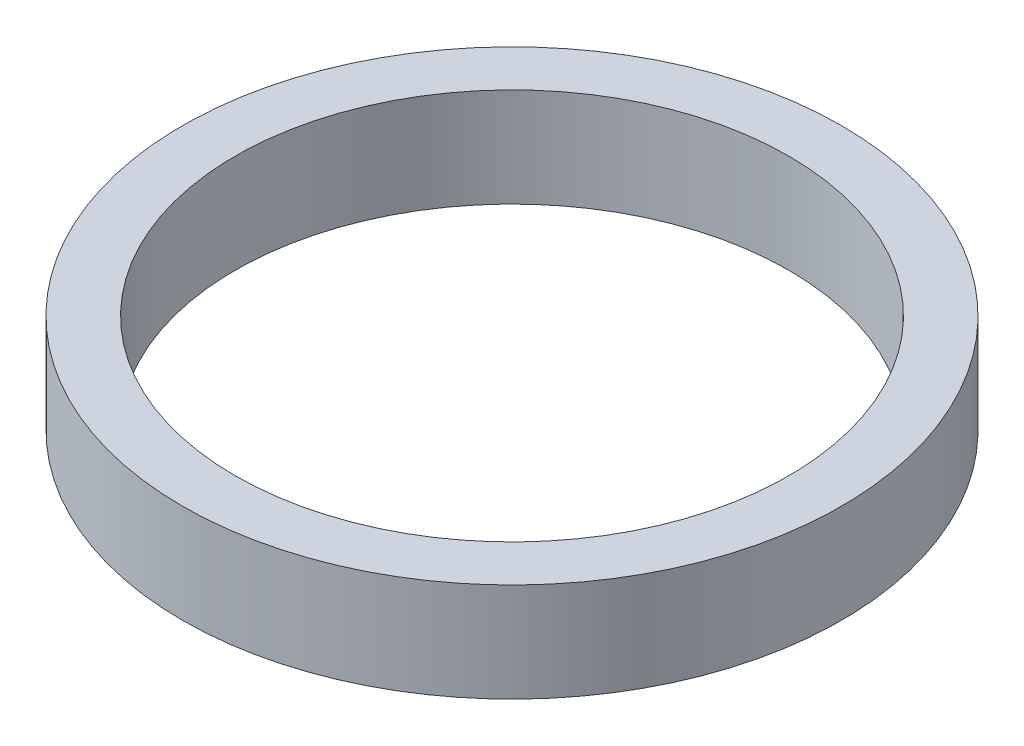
ISO-10303-21;
HEADER;
FILE_DESCRIPTION(('STEP AP214'),'2;1');
FILE_NAME('part.step','',(''),(''),'','','');
FILE_SCHEMA(('AUTOMOTIVE_DESIGN { 1 0 10303 214 1 1 1 1 }'));
ENDSEC;
DATA;
#1=APPLICATION_CONTEXT('core data for automotive mechanical design processes');
#2=APPLICATION_PROTOCOL_DEFINITION('international standard','automotive_design',2000,#1);
#3=PRODUCT_CONTEXT('',#1,'mechanical');
#4=PRODUCT('Part','Part','',(#3));
#5=PRODUCT_RELATED_PRODUCT_CATEGORY('part','',(#4));
#6=PRODUCT_DEFINITION_FORMATION('','',#4);
#7=PRODUCT_DEFINITION_CONTEXT('part definition',#1,'design');
#8=PRODUCT_DEFINITION('design','',#6,#7);
#9=PRODUCT_DEFINITION_SHAPE('','',#8);
#10=(LENGTH_UNIT() NAMED_UNIT(*) SI_UNIT(.MILLI.,.METRE.));
#11=(NAMED_UNIT(*) PLANE_ANGLE_UNIT() SI_UNIT($,.RADIAN.));
#12=(NAMED_UNIT(*) SI_UNIT($,.STERADIAN.) SOLID_ANGLE_UNIT());
#13=UNCERTAINTY_MEASURE_WITH_UNIT(LENGTH_MEASURE(1.E-05),#10,'distance_accuracy_value','');
#14=(GEOMETRIC_REPRESENTATION_CONTEXT(3) GLOBAL_UNCERTAINTY_ASSIGNED_CONTEXT((#13)) GLOBAL_UNIT_ASSIGNED_CONTEXT((#10,
#11,#12)) REPRESENTATION_CONTEXT('',''));
#15=CARTESIAN_POINT('',(0.,0.,0.));
#16=DIRECTION('',(0.,0.,1.));
#17=DIRECTION('',(1.,0.,0.));
#18=AXIS2_PLACEMENT_3D('',#15,#16,#17);
#19=CARTESIAN_POINT('',(0.,0.,0.));
#20=DIRECTION('',(0.,-1.,0.));
#21=DIRECTION('',(0.,0.,-1.));
#22=AXIS2_PLACEMENT_3D('',#19,#20,#21);
#23=CYLINDRICAL_SURFACE('',#22,5.);
#24=CARTESIAN_POINT('',(0.,1.5,0.));
#25=DIRECTION('',(0.,-1.,0.));
#26=DIRECTION('',(0.,0.,-1.));
#27=AXIS2_PLACEMENT_3D('',#24,#25,#26);
#28=CIRCLE('',#27,5.);
#29=CARTESIAN_POINT('',(0.,1.5,-5.));
#30=VERTEX_POINT('',#29);
#31=EDGE_CURVE('E10',#30,#30,#28,.T.);
#32=ORIENTED_EDGE('',*,*,#31,.T.);
#33=EDGE_LOOP('',(#32));
#34=FACE_BOUND('',#33,.T.);
#35=CARTESIAN_POINT('',(0.,0.,0.));
#36=DIRECTION('',(0.,-1.,0.));
#37=DIRECTION('',(0.,0.,-1.));
#38=AXIS2_PLACEMENT_3D('',#35,#36,#37);
#39=CIRCLE('',#38,5.);
#40=CARTESIAN_POINT('',(0.,0.,-5.));
#41=VERTEX_POINT('',#40);
#42=EDGE_CURVE('E45',#41,#41,#39,.T.);
#43=ORIENTED_EDGE('',*,*,#42,.F.);
#44=EDGE_LOOP('',(#43));
#45=FACE_BOUND('',#44,.T.);
#46=ADVANCED_FACE('F31',(#34,#45),#23,.T.);
#47=CARTESIAN_POINT('',(5.,1.5,0.));
#48=DIRECTION('',(0.,1.,0.));
#49=DIRECTION('',(0.,0.,1.));
#50=AXIS2_PLACEMENT_3D('',#47,#48,#49);
#51=PLANE('',#50);
#52=CARTESIAN_POINT('',(0.,1.5,0.));
#53=DIRECTION('',(0.,-1.,0.));
#54=DIRECTION('',(0.,0.,-1.));
#55=AXIS2_PLACEMENT_3D('',#52,#53,#54);
#56=CIRCLE('',#55,4.2);
#57=CARTESIAN_POINT('',(0.,1.5,-4.2));
#58=VERTEX_POINT('',#57);
#59=EDGE_CURVE('E37',#58,#58,#56,.T.);
#60=ORIENTED_EDGE('',*,*,#59,.T.);
#61=EDGE_LOOP('',(#60));
#62=FACE_BOUND('',#61,.T.);
#63=ORIENTED_EDGE('',*,*,#31,.F.);
#64=EDGE_LOOP('',(#63));
#65=FACE_BOUND('',#64,.T.);
#66=ADVANCED_FACE('F55',(#62,#65),#51,.T.);
#67=CARTESIAN_POINT('',(0.,0.,0.));
#68=DIRECTION('',(0.,-1.,0.));
#69=DIRECTION('',(0.,0.,-1.));
#70=AXIS2_PLACEMENT_3D('',#67,#68,#69);
#71=CYLINDRICAL_SURFACE('',#70,4.2);
#72=CARTESIAN_POINT('',(0.,0.,0.));
#73=DIRECTION('',(0.,-1.,0.));
#74=DIRECTION('',(0.,0.,-1.));
#75=AXIS2_PLACEMENT_3D('',#72,#73,#74);
#76=CIRCLE('',#75,4.2);
#77=CARTESIAN_POINT('',(0.,0.,-4.2));
#78=VERTEX_POINT('',#77);
#79=EDGE_CURVE('E41',#78,#78,#76,.T.);
#80=ORIENTED_EDGE('',*,*,#79,.T.);
#81=EDGE_LOOP('',(#80));
#82=FACE_BOUND('',#81,.T.);
#83=ORIENTED_EDGE('',*,*,#59,.F.);
#84=EDGE_LOOP('',(#83));
#85=FACE_BOUND('',#84,.T.);
#86=ADVANCED_FACE('F59',(#82,#85),#71,.F.);
#87=CARTESIAN_POINT('',(4.2,0.,0.));
#88=DIRECTION('',(0.,-1.,0.));
#89=DIRECTION('',(0.,0.,-1.));
#90=AXIS2_PLACEMENT_3D('',#87,#88,#89);
#91=PLANE('',#90);
#92=ORIENTED_EDGE('',*,*,#42,.T.);
#93=EDGE_LOOP('',(#92));
#94=FACE_BOUND('',#93,.T.);
#95=ORIENTED_EDGE('',*,*,#79,.F.);
#96=EDGE_LOOP('',(#95));
#97=FACE_BOUND('',#96,.T.);
#98=ADVANCED_FACE('F51',(#94,#97),#91,.T.);
#99=CLOSED_SHELL('',(#46,#66,#86,#98));
#100=MANIFOLD_SOLID_BREP('B2',#99);
#101=ADVANCED_BREP_SHAPE_REPRESENTATION('',(#18,#100),#14);
#102=SHAPE_DEFINITION_REPRESENTATION(#9,#101);
ENDSEC;
END-ISO-10303-21;
